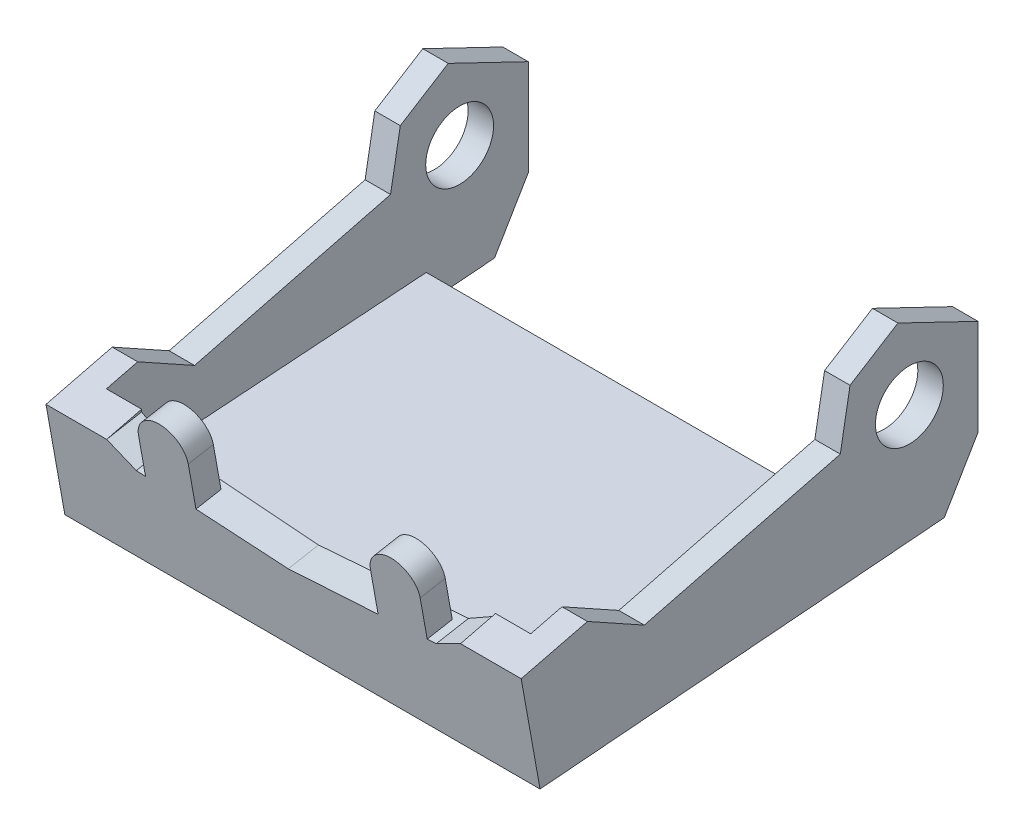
from build123d import *

# Parameters (mm, degrees)
BOSS_EXTRUDE3_DEPTH      = 28
BOSS_EXTRUDE3_DEPTH_BACK = 28
CUT_EXTRUDE2_DEPTH       = 25
CUT_EXTRUDE2_DEPTH_BACK  = 25
CUT_EXTRUDE3_DEPTH       = 63.25226239
BOSS_EXTRUDE5_DEPTH      = 3
CUT_EXTRUDE4_DEPTH       = 46.016887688
CUT_EXTRUDE4_DEPTH_BACK  = 46.016887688
SKETCH7_R                = 4
SKETCH9_W                = 50
SKETCH9_H                = 4.877620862
CUT_EXTRUDE5_DEPTH       = 10


with BuildPart() as part:
    # Sketch2 → Boss-Extrude3 (new, two sides: drawn at the far end of the back side and taken through both)
    with BuildSketch(Plane(origin=(0, 0, 0), x_dir=(0, 0, -1), z_dir=(1, 0, 0)).offset(-BOSS_EXTRUDE3_DEPTH_BACK)):
        Polygon((9.633497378, 4.654664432), (15.279732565, 8.183561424), (24.714702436, 3.640701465), (24.714702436, -7.700066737), (20.744162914, -14.410289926), (-26.897871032, -18.285961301), (-29.118495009, -5.915699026), (-21.310926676, -3.97690689), (-14.611795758, -7.700066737), (8.487260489, -1.798915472), align=None)
    extrude(amount=BOSS_EXTRUDE3_DEPTH + BOSS_EXTRUDE3_DEPTH_BACK)

    # Sketch4 → Cut-Extrude2 (cut, two sides: drawn at the far end of the back side and taken through both)
    with BuildSketch(Plane(origin=(0, 0, 0), x_dir=(0, 0, -1), z_dir=(1, 0, 0)).offset(-CUT_EXTRUDE2_DEPTH_BACK)):
        Polygon((-25, -11), (-25, -14.499620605), (25, -11), (25, 11), (-25, 11), align=None)
    extrude(amount=CUT_EXTRUDE2_DEPTH + CUT_EXTRUDE2_DEPTH_BACK, mode=Mode.SUBTRACT)

    # Sketch6 → Cut-Extrude3 (cut, through all)
    with BuildSketch(Plane(origin=(0, -5.248646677, 29.238239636), x_dir=(1, 0, 0), z_dir=(0, -0.17668876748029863, 0.984266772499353))):
        Polygon((-20.851272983, -0.677714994), (-17.673945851, -2.454634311), (0, -3.77940641), (17.673945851, -2.454634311), (20.851272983, -0.677714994), (20.851272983, 10.184333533), (-20.851272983, 10.184333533), align=None)
    extrude(amount=-CUT_EXTRUDE3_DEPTH, mode=Mode.SUBTRACT)

    # Sketch5 → Boss-Extrude5 (add)
    with BuildSketch(Plane(origin=(0, -5.248646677, 29.238239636), x_dir=(1, 0, 0), z_dir=(0, -0.17668876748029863, 0.984266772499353))):
        with BuildLine():
            Line((10.73373551, 2.14687371), (10.73373551, -4.092912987))
            Line((10.73373551, -4.092912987), (16.595524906, -4.092912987))
            Line((16.595524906, -4.092912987), (16.595524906, 2.14687371))
            ThreePointArc((16.595524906, 2.14687371), (13.664630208, 5.077768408), (10.73373551, 2.14687371))
        make_face()
    boss_extrude5 = extrude(amount=-BOSS_EXTRUDE5_DEPTH)

    # Mirror1: Boss-Extrude5 across plane
    add(boss_extrude5.mirror(Plane(origin=(0, 0, 0), x_dir=(0, 0, 1), z_dir=(1, 0, 0))))

    # Sketch7 → Cut-Extrude4 (cut, two sides: drawn at the far end of the back side and taken through both)
    with BuildSketch(Plane(origin=(0, 0, 0), x_dir=(0, 0, -1), z_dir=(1, 0, 0)).offset(-CUT_EXTRUDE4_DEPTH_BACK)):
        with Locations((16.626054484, -0.844318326)):
            Circle(SKETCH7_R)
    extrude(amount=CUT_EXTRUDE4_DEPTH + CUT_EXTRUDE4_DEPTH_BACK, mode=Mode.SUBTRACT)

    # Sketch9 → Cut-Extrude5 (cut, along a direction that is not the sketch's normal)
    with BuildSketch(Plane.XY.offset(-22.665393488)):
        with Locations((0, -11.971479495)):
            Rectangle(SKETCH9_W, SKETCH9_H)
    extrude(amount=CUT_EXTRUDE5_DEPTH, dir=(0, -0.08108198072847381, 0.9967074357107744), mode=Mode.SUBTRACT)


solid = part.part
